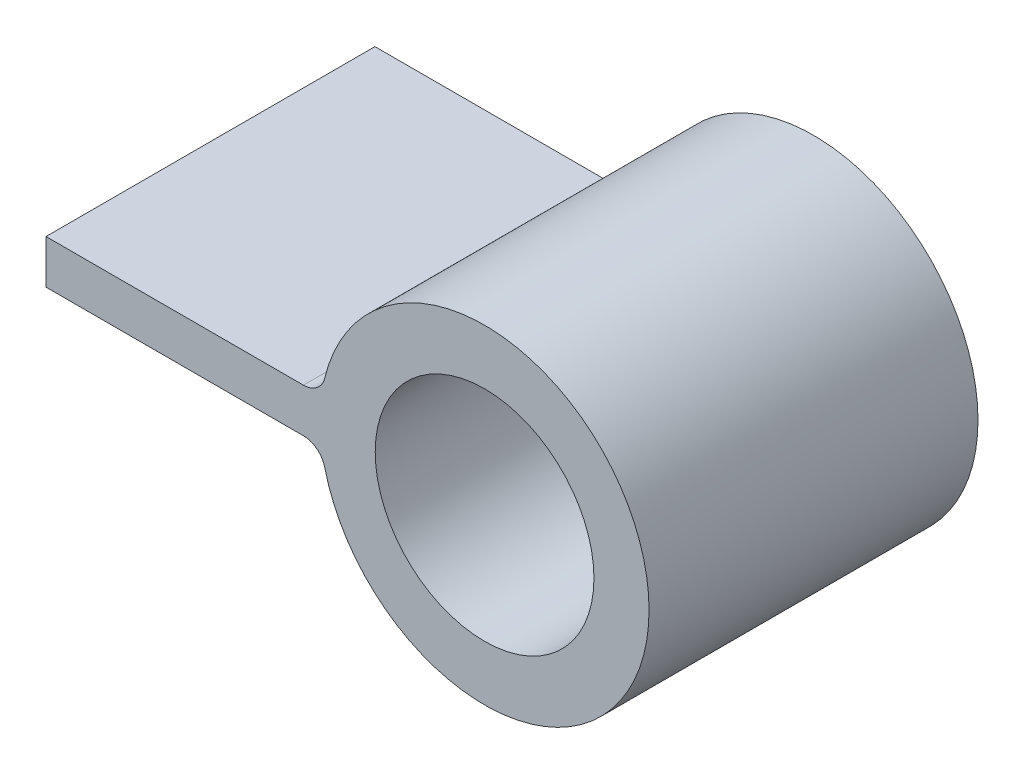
ISO-10303-21;
HEADER;
FILE_DESCRIPTION(('STEP AP214'),'2;1');
FILE_NAME('part.step','',(''),(''),'','','');
FILE_SCHEMA(('AUTOMOTIVE_DESIGN { 1 0 10303 214 1 1 1 1 }'));
ENDSEC;
DATA;
#1=APPLICATION_CONTEXT('core data for automotive mechanical design processes');
#2=APPLICATION_PROTOCOL_DEFINITION('international standard','automotive_design',2000,#1);
#3=PRODUCT_CONTEXT('',#1,'mechanical');
#4=PRODUCT('Part','Part','',(#3));
#5=PRODUCT_RELATED_PRODUCT_CATEGORY('part','',(#4));
#6=PRODUCT_DEFINITION_FORMATION('','',#4);
#7=PRODUCT_DEFINITION_CONTEXT('part definition',#1,'design');
#8=PRODUCT_DEFINITION('design','',#6,#7);
#9=PRODUCT_DEFINITION_SHAPE('','',#8);
#10=(LENGTH_UNIT() NAMED_UNIT(*) SI_UNIT(.MILLI.,.METRE.));
#11=(NAMED_UNIT(*) PLANE_ANGLE_UNIT() SI_UNIT($,.RADIAN.));
#12=(NAMED_UNIT(*) SI_UNIT($,.STERADIAN.) SOLID_ANGLE_UNIT());
#13=UNCERTAINTY_MEASURE_WITH_UNIT(LENGTH_MEASURE(1.E-05),#10,'distance_accuracy_value','');
#14=(GEOMETRIC_REPRESENTATION_CONTEXT(3) GLOBAL_UNCERTAINTY_ASSIGNED_CONTEXT((#13)) GLOBAL_UNIT_ASSIGNED_CONTEXT((#10,
#11,#12)) REPRESENTATION_CONTEXT('',''));
#15=CARTESIAN_POINT('',(0.,0.,0.));
#16=DIRECTION('',(0.,0.,1.));
#17=DIRECTION('',(1.,0.,0.));
#18=AXIS2_PLACEMENT_3D('',#15,#16,#17);
#19=CARTESIAN_POINT('',(0.,0.,30.));
#20=DIRECTION('',(0.,0.,-1.));
#21=DIRECTION('',(-1.,0.,0.));
#22=AXIS2_PLACEMENT_3D('',#19,#20,#21);
#23=CYLINDRICAL_SURFACE('',#22,15.);
#24=CARTESIAN_POINT('',(0.,0.,30.));
#25=DIRECTION('',(0.,0.,1.));
#26=DIRECTION('',(1.,0.,0.));
#27=AXIS2_PLACEMENT_3D('',#24,#25,#26);
#28=CIRCLE('',#27,15.);
#29=CARTESIAN_POINT('',(-14.5788632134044,-3.52941176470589,30.));
#30=VERTEX_POINT('',#29);
#31=CARTESIAN_POINT('',(-14.5788632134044,3.52941176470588,30.));
#32=VERTEX_POINT('',#31);
#33=EDGE_CURVE('E126',#30,#32,#28,.T.);
#34=ORIENTED_EDGE('',*,*,#33,.F.);
#35=DIRECTION('',(0.,0.,-1.));
#36=VECTOR('',#35,1.);
#37=CARTESIAN_POINT('',(-14.5788632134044,-3.52941176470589,30.));
#38=LINE('',#37,#36);
#39=CARTESIAN_POINT('',(-14.5788632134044,-3.52941176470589,0.));
#40=VERTEX_POINT('',#39);
#41=EDGE_CURVE('E130',#30,#40,#38,.T.);
#42=ORIENTED_EDGE('',*,*,#41,.T.);
#43=CARTESIAN_POINT('',(0.,0.,0.));
#44=DIRECTION('',(0.,0.,1.));
#45=DIRECTION('',(1.,0.,0.));
#46=AXIS2_PLACEMENT_3D('',#43,#44,#45);
#47=CIRCLE('',#46,15.);
#48=CARTESIAN_POINT('',(-14.5788632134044,3.52941176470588,0.));
#49=VERTEX_POINT('',#48);
#50=EDGE_CURVE('E123',#40,#49,#47,.T.);
#51=ORIENTED_EDGE('',*,*,#50,.T.);
#52=DIRECTION('',(0.,0.,-1.));
#53=VECTOR('',#52,1.);
#54=CARTESIAN_POINT('',(-14.5788632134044,3.52941176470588,30.));
#55=LINE('',#54,#53);
#56=EDGE_CURVE('E128',#49,#32,#55,.F.);
#57=ORIENTED_EDGE('',*,*,#56,.T.);
#58=EDGE_LOOP('',(#34,#42,#51,#57));
#59=FACE_BOUND('',#58,.T.);
#60=ADVANCED_FACE('F36',(#59),#23,.T.);
#61=CARTESIAN_POINT('',(0.,0.,30.));
#62=DIRECTION('',(0.,0.,1.));
#63=DIRECTION('',(1.,0.,0.));
#64=AXIS2_PLACEMENT_3D('',#61,#62,#63);
#65=PLANE('',#64);
#66=CARTESIAN_POINT('',(0.,0.,30.));
#67=DIRECTION('',(0.,0.,1.));
#68=DIRECTION('',(1.,0.,0.));
#69=AXIS2_PLACEMENT_3D('',#66,#67,#68);
#70=CIRCLE('',#69,9.975);
#71=CARTESIAN_POINT('',(9.975,0.,30.));
#72=VERTEX_POINT('',#71);
#73=EDGE_CURVE('E96',#72,#72,#70,.T.);
#74=ORIENTED_EDGE('',*,*,#73,.F.);
#75=EDGE_LOOP('',(#74));
#76=FACE_BOUND('',#75,.T.);
#77=DIRECTION('',(1.,0.,0.));
#78=VECTOR('',#77,1.);
#79=CARTESIAN_POINT('',(-40.,-2.00000000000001,30.));
#80=LINE('',#79,#78);
#81=CARTESIAN_POINT('',(-40.,-2.00000000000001,30.));
#82=VERTEX_POINT('',#81);
#83=CARTESIAN_POINT('',(-16.5227116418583,-2.00000000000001,30.));
#84=VERTEX_POINT('',#83);
#85=EDGE_CURVE('E86',#82,#84,#80,.T.);
#86=ORIENTED_EDGE('',*,*,#85,.T.);
#87=CARTESIAN_POINT('',(-16.5227116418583,-4.,30.));
#88=DIRECTION('',(0.,0.,1.));
#89=DIRECTION('',(1.,0.,0.));
#90=AXIS2_PLACEMENT_3D('',#87,#88,#89);
#91=CIRCLE('',#90,2.);
#92=EDGE_CURVE('E138',#84,#30,#91,.F.);
#93=ORIENTED_EDGE('',*,*,#92,.T.);
#94=ORIENTED_EDGE('',*,*,#33,.T.);
#95=CARTESIAN_POINT('',(-16.5227116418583,3.99999999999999,30.));
#96=DIRECTION('',(0.,0.,1.));
#97=DIRECTION('',(1.,0.,0.));
#98=AXIS2_PLACEMENT_3D('',#95,#96,#97);
#99=CIRCLE('',#98,2.);
#100=CARTESIAN_POINT('',(-16.5227116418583,1.99999999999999,30.));
#101=VERTEX_POINT('',#100);
#102=EDGE_CURVE('E11',#32,#101,#99,.F.);
#103=ORIENTED_EDGE('',*,*,#102,.T.);
#104=DIRECTION('',(-1.,0.,0.));
#105=VECTOR('',#104,1.);
#106=CARTESIAN_POINT('',(-40.,1.99999999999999,30.));
#107=LINE('',#106,#105);
#108=CARTESIAN_POINT('',(-40.,1.99999999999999,30.));
#109=VERTEX_POINT('',#108);
#110=EDGE_CURVE('E109',#101,#109,#107,.T.);
#111=ORIENTED_EDGE('',*,*,#110,.T.);
#112=DIRECTION('',(0.,-1.,0.));
#113=VECTOR('',#112,1.);
#114=CARTESIAN_POINT('',(-40.,-2.00000000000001,30.));
#115=LINE('',#114,#113);
#116=EDGE_CURVE('E97',#109,#82,#115,.T.);
#117=ORIENTED_EDGE('',*,*,#116,.T.);
#118=EDGE_LOOP('',(#86,#93,#94,#103,#111,#117));
#119=FACE_BOUND('',#118,.T.);
#120=ADVANCED_FACE('F108',(#76,#119),#65,.T.);
#121=CARTESIAN_POINT('',(0.,0.,0.));
#122=DIRECTION('',(0.,0.,1.));
#123=DIRECTION('',(1.,0.,0.));
#124=AXIS2_PLACEMENT_3D('',#121,#122,#123);
#125=PLANE('',#124);
#126=CARTESIAN_POINT('',(0.,0.,0.));
#127=DIRECTION('',(0.,0.,1.));
#128=DIRECTION('',(1.,0.,0.));
#129=AXIS2_PLACEMENT_3D('',#126,#127,#128);
#130=CIRCLE('',#129,9.975);
#131=CARTESIAN_POINT('',(9.975,0.,0.));
#132=VERTEX_POINT('',#131);
#133=EDGE_CURVE('E120',#132,#132,#130,.T.);
#134=ORIENTED_EDGE('',*,*,#133,.T.);
#135=EDGE_LOOP('',(#134));
#136=FACE_BOUND('',#135,.T.);
#137=ORIENTED_EDGE('',*,*,#50,.F.);
#138=CARTESIAN_POINT('',(-16.5227116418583,-4.,0.));
#139=DIRECTION('',(0.,0.,1.));
#140=DIRECTION('',(1.,0.,0.));
#141=AXIS2_PLACEMENT_3D('',#138,#139,#140);
#142=CIRCLE('',#141,2.);
#143=CARTESIAN_POINT('',(-16.5227116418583,-2.00000000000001,0.));
#144=VERTEX_POINT('',#143);
#145=EDGE_CURVE('E136',#40,#144,#142,.T.);
#146=ORIENTED_EDGE('',*,*,#145,.T.);
#147=DIRECTION('',(1.,0.,0.));
#148=VECTOR('',#147,1.);
#149=CARTESIAN_POINT('',(-40.,-2.00000000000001,0.));
#150=LINE('',#149,#148);
#151=CARTESIAN_POINT('',(-40.,-2.00000000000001,0.));
#152=VERTEX_POINT('',#151);
#153=EDGE_CURVE('E106',#152,#144,#150,.T.);
#154=ORIENTED_EDGE('',*,*,#153,.F.);
#155=DIRECTION('',(0.,-1.,0.));
#156=VECTOR('',#155,1.);
#157=CARTESIAN_POINT('',(-40.,-2.00000000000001,0.));
#158=LINE('',#157,#156);
#159=CARTESIAN_POINT('',(-40.,1.99999999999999,0.));
#160=VERTEX_POINT('',#159);
#161=EDGE_CURVE('E105',#160,#152,#158,.T.);
#162=ORIENTED_EDGE('',*,*,#161,.F.);
#163=DIRECTION('',(-1.,0.,0.));
#164=VECTOR('',#163,1.);
#165=CARTESIAN_POINT('',(-40.,1.99999999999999,0.));
#166=LINE('',#165,#164);
#167=CARTESIAN_POINT('',(-16.5227116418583,1.99999999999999,0.));
#168=VERTEX_POINT('',#167);
#169=EDGE_CURVE('E112',#168,#160,#166,.T.);
#170=ORIENTED_EDGE('',*,*,#169,.F.);
#171=CARTESIAN_POINT('',(-16.5227116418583,3.99999999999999,0.));
#172=DIRECTION('',(0.,0.,1.));
#173=DIRECTION('',(1.,0.,0.));
#174=AXIS2_PLACEMENT_3D('',#171,#172,#173);
#175=CIRCLE('',#174,2.);
#176=EDGE_CURVE('E43',#168,#49,#175,.T.);
#177=ORIENTED_EDGE('',*,*,#176,.T.);
#178=EDGE_LOOP('',(#137,#146,#154,#162,#170,#177));
#179=FACE_BOUND('',#178,.T.);
#180=ADVANCED_FACE('F142',(#136,#179),#125,.F.);
#181=CARTESIAN_POINT('',(0.,0.,0.));
#182=DIRECTION('',(0.,0.,1.));
#183=DIRECTION('',(1.,0.,0.));
#184=AXIS2_PLACEMENT_3D('',#181,#182,#183);
#185=CYLINDRICAL_SURFACE('',#184,9.975);
#186=ORIENTED_EDGE('',*,*,#133,.F.);
#187=EDGE_LOOP('',(#186));
#188=FACE_BOUND('',#187,.T.);
#189=ORIENTED_EDGE('',*,*,#73,.T.);
#190=EDGE_LOOP('',(#189));
#191=FACE_BOUND('',#190,.T.);
#192=ADVANCED_FACE('F169',(#188,#191),#185,.F.);
#193=CARTESIAN_POINT('',(-40.,-2.00000000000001,55.4502357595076));
#194=DIRECTION('',(1.,0.,0.));
#195=DIRECTION('',(0.,0.,-1.));
#196=AXIS2_PLACEMENT_3D('',#193,#194,#195);
#197=PLANE('',#196);
#198=ORIENTED_EDGE('',*,*,#116,.F.);
#199=DIRECTION('',(0.,0.,-1.));
#200=VECTOR('',#199,1.);
#201=CARTESIAN_POINT('',(-40.,1.99999999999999,55.4502357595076));
#202=LINE('',#201,#200);
#203=EDGE_CURVE('E116',#109,#160,#202,.T.);
#204=ORIENTED_EDGE('',*,*,#203,.T.);
#205=ORIENTED_EDGE('',*,*,#161,.T.);
#206=DIRECTION('',(0.,0.,-1.));
#207=VECTOR('',#206,1.);
#208=CARTESIAN_POINT('',(-40.,-2.00000000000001,55.4502357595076));
#209=LINE('',#208,#207);
#210=EDGE_CURVE('E90',#82,#152,#209,.T.);
#211=ORIENTED_EDGE('',*,*,#210,.F.);
#212=EDGE_LOOP('',(#198,#204,#205,#211));
#213=FACE_BOUND('',#212,.T.);
#214=ADVANCED_FACE('F102',(#213),#197,.F.);
#215=CARTESIAN_POINT('',(-40.,-2.00000000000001,55.4502357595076));
#216=DIRECTION('',(0.,1.,0.));
#217=DIRECTION('',(0.,0.,1.));
#218=AXIS2_PLACEMENT_3D('',#215,#216,#217);
#219=PLANE('',#218);
#220=ORIENTED_EDGE('',*,*,#153,.T.);
#221=DIRECTION('',(0.,0.,1.));
#222=VECTOR('',#221,1.);
#223=CARTESIAN_POINT('',(-16.5227116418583,-2.00000000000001,30.));
#224=LINE('',#223,#222);
#225=EDGE_CURVE('E93',#144,#84,#224,.T.);
#226=ORIENTED_EDGE('',*,*,#225,.T.);
#227=ORIENTED_EDGE('',*,*,#85,.F.);
#228=ORIENTED_EDGE('',*,*,#210,.T.);
#229=EDGE_LOOP('',(#220,#226,#227,#228));
#230=FACE_BOUND('',#229,.T.);
#231=ADVANCED_FACE('F89',(#230),#219,.F.);
#232=CARTESIAN_POINT('',(-40.,1.99999999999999,55.4502357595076));
#233=DIRECTION('',(0.,-1.,0.));
#234=DIRECTION('',(0.,0.,-1.));
#235=AXIS2_PLACEMENT_3D('',#232,#233,#234);
#236=PLANE('',#235);
#237=ORIENTED_EDGE('',*,*,#110,.F.);
#238=DIRECTION('',(0.,0.,1.));
#239=VECTOR('',#238,1.);
#240=CARTESIAN_POINT('',(-16.5227116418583,1.99999999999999,0.));
#241=LINE('',#240,#239);
#242=EDGE_CURVE('E134',#101,#168,#241,.F.);
#243=ORIENTED_EDGE('',*,*,#242,.T.);
#244=ORIENTED_EDGE('',*,*,#169,.T.);
#245=ORIENTED_EDGE('',*,*,#203,.F.);
#246=EDGE_LOOP('',(#237,#243,#244,#245));
#247=FACE_BOUND('',#246,.T.);
#248=ADVANCED_FACE('F148',(#247),#236,.F.);
#249=CARTESIAN_POINT('',(-16.5227116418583,-4.,30.));
#250=DIRECTION('',(0.,0.,-1.));
#251=DIRECTION('',(-1.,0.,0.));
#252=AXIS2_PLACEMENT_3D('',#249,#250,#251);
#253=CYLINDRICAL_SURFACE('',#252,2.);
#254=ORIENTED_EDGE('',*,*,#92,.F.);
#255=ORIENTED_EDGE('',*,*,#225,.F.);
#256=ORIENTED_EDGE('',*,*,#145,.F.);
#257=ORIENTED_EDGE('',*,*,#41,.F.);
#258=EDGE_LOOP('',(#254,#255,#256,#257));
#259=FACE_BOUND('',#258,.T.);
#260=ADVANCED_FACE('F152',(#259),#253,.F.);
#261=CARTESIAN_POINT('',(-16.5227116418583,3.99999999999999,30.));
#262=DIRECTION('',(0.,0.,-1.));
#263=DIRECTION('',(-1.,0.,0.));
#264=AXIS2_PLACEMENT_3D('',#261,#262,#263);
#265=CYLINDRICAL_SURFACE('',#264,2.);
#266=ORIENTED_EDGE('',*,*,#102,.F.);
#267=ORIENTED_EDGE('',*,*,#56,.F.);
#268=ORIENTED_EDGE('',*,*,#176,.F.);
#269=ORIENTED_EDGE('',*,*,#242,.F.);
#270=EDGE_LOOP('',(#266,#267,#268,#269));
#271=FACE_BOUND('',#270,.T.);
#272=ADVANCED_FACE('F146',(#271),#265,.F.);
#273=CLOSED_SHELL('',(#60,#120,#180,#192,#214,#231,#248,#260,#272));
#274=MANIFOLD_SOLID_BREP('B2',#273);
#275=ADVANCED_BREP_SHAPE_REPRESENTATION('',(#18,#274),#14);
#276=SHAPE_DEFINITION_REPRESENTATION(#9,#275);
ENDSEC;
END-ISO-10303-21;
